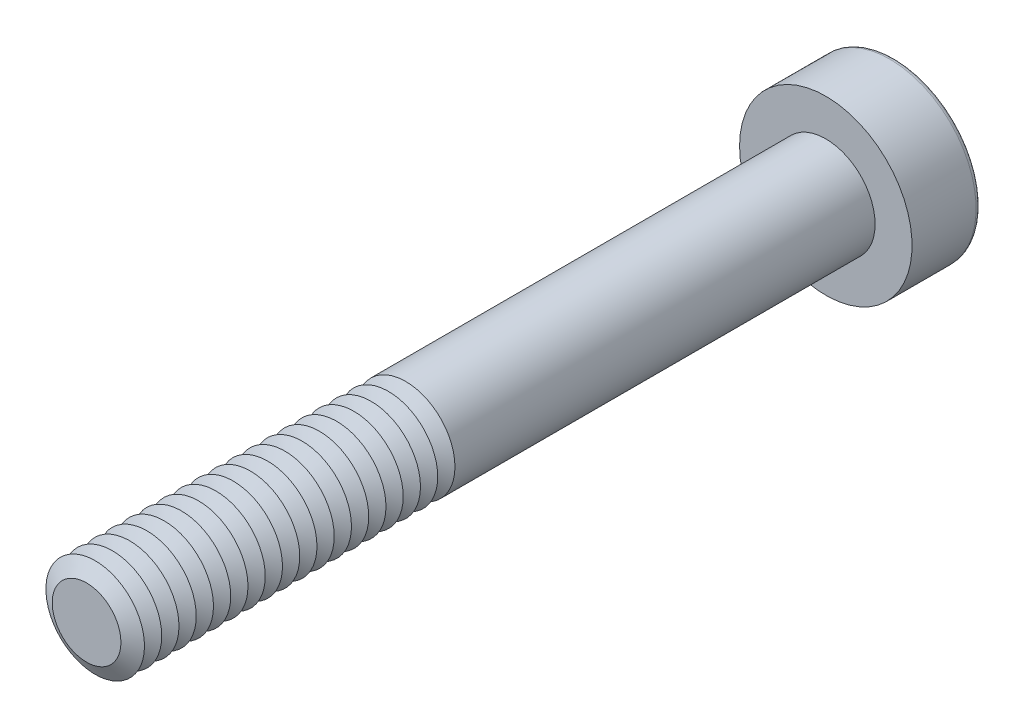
from build123d import *

# Parameters (mm, degrees)
SKETCH1_R           = 2
BOSS_EXTRUDE1_DEPTH = 30
SKETCH2_R           = 3.5
BOSS_EXTRUDE2_DEPTH = 2.8
CUT_EXTRUDE1_DEPTH  = 1.875
FILLET1_R           = 0.2
LPATTERN1_COUNT     = 19
LPATTERN1_PITCH     = 0.7


with BuildPart() as part:
    # Sketch1 → Boss-Extrude1 (new body)
    with BuildSketch(Plane.XY):
        Circle(SKETCH1_R)
    extrude(amount=BOSS_EXTRUDE1_DEPTH)

    # Sketch2 → Boss-Extrude2 (add)
    with BuildSketch(Plane(origin=(0, 0, 0), x_dir=(-1, 0, 0), z_dir=(0, 0, -1))):
        Circle(SKETCH2_R)
    extrude(amount=BOSS_EXTRUDE2_DEPTH)

    # Sketch3 → Cut-Extrude1 (cut)
    with BuildSketch(Plane(origin=(0, 0, -2.8), x_dir=(-1, 0, 0), z_dir=(0, 0, -1))):
        Polygon((-0.721687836, 1.25), (-1.443375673, 0), (-0.721687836, -1.25), (0.721687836, -1.25), (1.443375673, 0), (0.721687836, 1.25), align=None)
    extrude(amount=-CUT_EXTRUDE1_DEPTH, mode=Mode.SUBTRACT)

    # Fillet1
    fillet1_edges = [part.edges().sort_by_distance(p)[0] for p in [
        (3.5, 0, -2.8),
    ]]
    fillet(fillet1_edges, radius=FILLET1_R)

    # Cut-Extrude2 cone 1 section (on through the dimple's axis) → Cut-Extrude2 (revolve, cut)
    with BuildSketch(Plane(origin=(0, 0, -0.925), x_dir=(0, 1, 0), z_dir=(1, 0, 0))):
        Polygon((0, 0), (1.25, 0), (0, 0.721687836), align=None)
    revolve(axis=Axis((0, 0, -0.925), (0, 0, 1)), mode=Mode.SUBTRACT)

    # Cut-Extrude3 cone 1 section (on through the dimple's axis) → Cut-Extrude3 (revolve, cut)
    with BuildSketch(Plane(origin=(0, 0, -2.8), x_dir=(0, 1, 0), z_dir=(1, 0, 0))):
        Polygon((0, 0), (1.443375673, 0), (0, 0.386751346), align=None)
    revolve(axis=Axis((0, 0, -2.8), (0, 0, 1)), mode=Mode.SUBTRACT)

    # Sketch7 → Cut-Revolve1 (revolve, cut)
    with BuildSketch(Plane(origin=(0, 0, 0), x_dir=(0, 0, -1), z_dir=(1, 0, 0)), mode=Mode.PRIVATE) as cut_revolve1_sk:
        Polygon((-30, 1.393782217), (-29.65, 2), (-30.35, 2), align=None)
    cut_revolve1 = revolve(cut_revolve1_sk.sketch.rotate(Axis((0, 0, 30), (0, 0, -1)), 90), axis=Axis((0, 0, 30), (0, 0, -1)), mode=Mode.SUBTRACT)

    # LPattern1: Cut-Revolve1 ×19
    with Locations(*[(0, 0, -i * LPATTERN1_PITCH) for i in range(1, LPATTERN1_COUNT)]):
        add(cut_revolve1, mode=Mode.SUBTRACT)


solid = part.part
